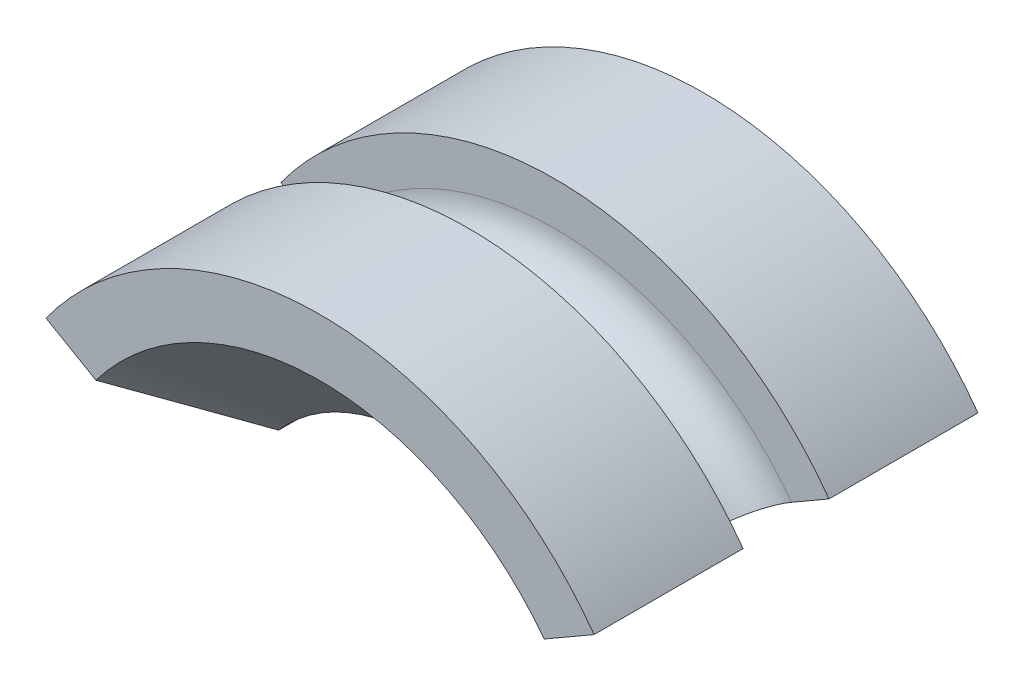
ISO-10303-21;
HEADER;
FILE_DESCRIPTION(('STEP AP214'),'2;1');
FILE_NAME('part.step','',(''),(''),'','','');
FILE_SCHEMA(('AUTOMOTIVE_DESIGN { 1 0 10303 214 1 1 1 1 }'));
ENDSEC;
DATA;
#1=APPLICATION_CONTEXT('core data for automotive mechanical design processes');
#2=APPLICATION_PROTOCOL_DEFINITION('international standard','automotive_design',2000,#1);
#3=PRODUCT_CONTEXT('',#1,'mechanical');
#4=PRODUCT('Part','Part','',(#3));
#5=PRODUCT_RELATED_PRODUCT_CATEGORY('part','',(#4));
#6=PRODUCT_DEFINITION_FORMATION('','',#4);
#7=PRODUCT_DEFINITION_CONTEXT('part definition',#1,'design');
#8=PRODUCT_DEFINITION('design','',#6,#7);
#9=PRODUCT_DEFINITION_SHAPE('','',#8);
#10=(LENGTH_UNIT() NAMED_UNIT(*) SI_UNIT(.MILLI.,.METRE.));
#11=(NAMED_UNIT(*) PLANE_ANGLE_UNIT() SI_UNIT($,.RADIAN.));
#12=(NAMED_UNIT(*) SI_UNIT($,.STERADIAN.) SOLID_ANGLE_UNIT());
#13=UNCERTAINTY_MEASURE_WITH_UNIT(LENGTH_MEASURE(1.E-05),#10,'distance_accuracy_value','');
#14=(GEOMETRIC_REPRESENTATION_CONTEXT(3) GLOBAL_UNCERTAINTY_ASSIGNED_CONTEXT((#13)) GLOBAL_UNIT_ASSIGNED_CONTEXT((#10,
#11,#12)) REPRESENTATION_CONTEXT('',''));
#15=CARTESIAN_POINT('',(0.,0.,0.));
#16=DIRECTION('',(0.,0.,1.));
#17=DIRECTION('',(1.,0.,0.));
#18=AXIS2_PLACEMENT_3D('',#15,#16,#17);
#19=CARTESIAN_POINT('',(0.,0.,0.));
#20=DIRECTION('',(0.,0.,-1.));
#21=DIRECTION('',(0.,1.,0.));
#22=AXIS2_PLACEMENT_3D('',#19,#20,#21);
#23=CYLINDRICAL_SURFACE('',#22,5.9);
#24=CARTESIAN_POINT('',(0.,0.,4.1));
#25=DIRECTION('',(0.,0.,-1.));
#26=DIRECTION('',(0.,1.,0.));
#27=AXIS2_PLACEMENT_3D('',#24,#25,#26);
#28=CIRCLE('',#27,5.9);
#29=CARTESIAN_POINT('',(-4.78306010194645,3.45432136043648,4.09999999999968));
#30=VERTEX_POINT('',#29);
#31=CARTESIAN_POINT('',(4.78306010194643,3.45432136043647,4.10000000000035));
#32=VERTEX_POINT('',#31);
#33=EDGE_CURVE('E109',#30,#32,#28,.T.);
#34=ORIENTED_EDGE('',*,*,#33,.F.);
#35=DIRECTION('',(0.,0.,-1.));
#36=VECTOR('',#35,1.);
#37=CARTESIAN_POINT('',(-4.78306010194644,3.45432136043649,6.69999999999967));
#38=LINE('',#37,#36);
#39=CARTESIAN_POINT('',(-4.78306010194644,3.45432136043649,6.69999999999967));
#40=VERTEX_POINT('',#39);
#41=EDGE_CURVE('E92',#40,#30,#38,.T.);
#42=ORIENTED_EDGE('',*,*,#41,.F.);
#43=CARTESIAN_POINT('',(0.,0.,6.7));
#44=DIRECTION('',(0.,0.,-1.));
#45=DIRECTION('',(0.,1.,0.));
#46=AXIS2_PLACEMENT_3D('',#43,#44,#45);
#47=CIRCLE('',#46,5.9);
#48=CARTESIAN_POINT('',(4.78306010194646,3.45432136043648,6.70000000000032));
#49=VERTEX_POINT('',#48);
#50=EDGE_CURVE('E107',#40,#49,#47,.T.);
#51=ORIENTED_EDGE('',*,*,#50,.T.);
#52=DIRECTION('',(0.,0.,-1.));
#53=VECTOR('',#52,1.);
#54=CARTESIAN_POINT('',(4.78306010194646,3.45432136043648,6.70000000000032));
#55=LINE('',#54,#53);
#56=EDGE_CURVE('E248',#49,#32,#55,.T.);
#57=ORIENTED_EDGE('',*,*,#56,.T.);
#58=EDGE_LOOP('',(#34,#42,#51,#57));
#59=FACE_BOUND('',#58,.T.);
#60=ADVANCED_FACE('F14',(#59),#23,.T.);
#61=CARTESIAN_POINT('',(0.,0.,6.7));
#62=DIRECTION('',(0.,0.,1.));
#63=DIRECTION('',(0.,-1.,0.));
#64=AXIS2_PLACEMENT_3D('',#61,#62,#63);
#65=CONICAL_SURFACE('',#64,4.9,0.785398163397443);
#66=CARTESIAN_POINT('',(0.,0.,6.7));
#67=DIRECTION('',(0.,0.,-1.));
#68=DIRECTION('',(0.,1.,0.));
#69=AXIS2_PLACEMENT_3D('',#66,#67,#68);
#70=CIRCLE('',#69,4.9);
#71=CARTESIAN_POINT('',(-3.91159114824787,2.9511785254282,6.69999999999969));
#72=VERTEX_POINT('',#71);
#73=CARTESIAN_POINT('',(3.91159114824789,2.9511785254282,6.70000000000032));
#74=VERTEX_POINT('',#73);
#75=EDGE_CURVE('E116',#72,#74,#70,.T.);
#76=ORIENTED_EDGE('',*,*,#75,.F.);
#77=CARTESIAN_POINT('',(-3.91176566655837,2.95127928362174,6.70019999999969));
#78=CARTESIAN_POINT('',(-3.78786317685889,2.8797441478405,6.55821006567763));
#79=CARTESIAN_POINT('',(-3.66392328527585,2.80818741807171,6.41626359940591));
#80=CARTESIAN_POINT('',(-3.41593568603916,2.66501171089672,6.1324967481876));
#81=CARTESIAN_POINT('',(-3.29188797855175,2.59339273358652,5.99067636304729));
#82=CARTESIAN_POINT('',(-3.04365124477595,2.45007318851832,5.70720025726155));
#83=CARTESIAN_POINT('',(-2.91946221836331,2.3783726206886,5.56554453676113));
#84=CARTESIAN_POINT('',(-2.67087873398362,2.23485287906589,5.28247322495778));
#85=CARTESIAN_POINT('',(-2.54648427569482,2.16303370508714,5.14105763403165));
#86=CARTESIAN_POINT('',(-2.42195518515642,2.09113680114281,4.99979999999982));
#87=B_SPLINE_CURVE_WITH_KNOTS('',3,(#77,#78,#79,#80,#81,#82,#83,#84,#85,#86),.UNSPECIFIED.,.F.,
.F.,(4,2,2,2,4),(0.,0.604708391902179,1.20941585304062,1.81412384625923,2.41883278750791),.UNSPECIFIED.);
#88=CARTESIAN_POINT('',(-2.42213151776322,2.09123860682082,4.99999999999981));
#89=VERTEX_POINT('',#88);
#90=EDGE_CURVE('E95',#72,#89,#87,.T.);
#91=ORIENTED_EDGE('',*,*,#90,.T.);
#92=CARTESIAN_POINT('',(0.,0.,5.));
#93=DIRECTION('',(0.,0.,-1.));
#94=DIRECTION('',(0.,1.,0.));
#95=AXIS2_PLACEMENT_3D('',#92,#93,#94);
#96=CIRCLE('',#95,3.2);
#97=CARTESIAN_POINT('',(2.42213151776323,2.09123860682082,5.00000000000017));
#98=VERTEX_POINT('',#97);
#99=EDGE_CURVE('E130',#89,#98,#96,.T.);
#100=ORIENTED_EDGE('',*,*,#99,.T.);
#101=CARTESIAN_POINT('',(2.42195518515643,2.0911368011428,4.99980000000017));
#102=CARTESIAN_POINT('',(2.54648427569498,2.16303370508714,5.14105763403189));
#103=CARTESIAN_POINT('',(2.67087873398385,2.2348528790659,5.28247322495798));
#104=CARTESIAN_POINT('',(2.91946221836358,2.37837262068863,5.56554453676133));
#105=CARTESIAN_POINT('',(3.04365124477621,2.45007318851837,5.70720025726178));
#106=CARTESIAN_POINT('',(3.29188797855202,2.5933927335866,5.99067636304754));
#107=CARTESIAN_POINT('',(3.41593568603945,2.66501171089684,6.13249674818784));
#108=CARTESIAN_POINT('',(3.6639232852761,2.80818741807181,6.41626359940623));
#109=CARTESIAN_POINT('',(3.78786317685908,2.87974414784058,6.55821006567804));
#110=CARTESIAN_POINT('',(3.91176566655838,2.95127928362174,6.70020000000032));
#111=B_SPLINE_CURVE_WITH_KNOTS('',3,(#101,#102,#103,#104,#105,#106,#107,#108,#109,#110),
.UNSPECIFIED.,.F.,.F.,(4,2,2,2,4),(0.,0.604708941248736,1.20941693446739,1.81412439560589,
2.41883278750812),.UNSPECIFIED.);
#112=EDGE_CURVE('E181',#98,#74,#111,.T.);
#113=ORIENTED_EDGE('',*,*,#112,.T.);
#114=EDGE_LOOP('',(#76,#91,#100,#113));
#115=FACE_BOUND('',#114,.T.);
#116=ADVANCED_FACE('F16',(#115),#65,.F.);
#117=CARTESIAN_POINT('',(0.,0.,0.));
#118=DIRECTION('',(0.,0.,-1.));
#119=DIRECTION('',(0.,1.,0.));
#120=AXIS2_PLACEMENT_3D('',#117,#118,#119);
#121=CYLINDRICAL_SURFACE('',#120,3.2);
#122=ORIENTED_EDGE('',*,*,#99,.F.);
#123=DIRECTION('',(0.,0.,-1.));
#124=VECTOR('',#123,1.);
#125=CARTESIAN_POINT('',(-2.42213151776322,2.09123860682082,6.69999999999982));
#126=LINE('',#125,#124);
#127=CARTESIAN_POINT('',(-2.42213151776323,2.09123860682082,1.69999999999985));
#128=VERTEX_POINT('',#127);
#129=EDGE_CURVE('E110',#89,#128,#126,.T.);
#130=ORIENTED_EDGE('',*,*,#129,.T.);
#131=CARTESIAN_POINT('',(0.,0.,1.7));
#132=DIRECTION('',(0.,0.,-1.));
#133=DIRECTION('',(0.,1.,0.));
#134=AXIS2_PLACEMENT_3D('',#131,#132,#133);
#135=CIRCLE('',#134,3.2);
#136=CARTESIAN_POINT('',(2.42213151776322,2.09123860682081,1.70000000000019));
#137=VERTEX_POINT('',#136);
#138=EDGE_CURVE('E127',#128,#137,#135,.T.);
#139=ORIENTED_EDGE('',*,*,#138,.T.);
#140=DIRECTION('',(0.,0.,-1.));
#141=VECTOR('',#140,1.);
#142=CARTESIAN_POINT('',(2.42213151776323,2.09123860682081,6.7000000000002));
#143=LINE('',#142,#141);
#144=EDGE_CURVE('E246',#98,#137,#143,.T.);
#145=ORIENTED_EDGE('',*,*,#144,.F.);
#146=EDGE_LOOP('',(#122,#130,#139,#145));
#147=FACE_BOUND('',#146,.T.);
#148=ADVANCED_FACE('F209',(#147),#121,.F.);
#149=CARTESIAN_POINT('',(0.,0.,1.7));
#150=DIRECTION('',(0.,0.,-1.));
#151=DIRECTION('',(0.,1.,0.));
#152=AXIS2_PLACEMENT_3D('',#149,#150,#151);
#153=CONICAL_SURFACE('',#152,3.2,0.785398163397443);
#154=ORIENTED_EDGE('',*,*,#138,.F.);
#155=CARTESIAN_POINT('',(-2.42195518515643,2.09113680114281,1.70019999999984));
#156=CARTESIAN_POINT('',(-2.54648427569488,2.16303370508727,1.5589423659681));
#157=CARTESIAN_POINT('',(-2.6708787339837,2.23485287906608,1.417526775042));
#158=CARTESIAN_POINT('',(-2.9194622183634,2.37837262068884,1.13445546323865));
#159=CARTESIAN_POINT('',(-3.04365124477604,2.45007318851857,0.992799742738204));
#160=CARTESIAN_POINT('',(-3.29188797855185,2.5933927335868,0.709323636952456));
#161=CARTESIAN_POINT('',(-3.41593568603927,2.66501171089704,0.56750325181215));
#162=CARTESIAN_POINT('',(-3.66392328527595,2.80818741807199,0.283736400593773));
#163=CARTESIAN_POINT('',(-3.78786317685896,2.87974414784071,0.141789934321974));
#164=CARTESIAN_POINT('',(-3.91176566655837,2.95127928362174,-0.000200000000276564));
#165=B_SPLINE_CURVE_WITH_KNOTS('',3,(#155,#156,#157,#158,#159,#160,#161,#162,#163,#164),
.UNSPECIFIED.,.F.,.F.,(4,2,2,2,4),(0.,0.604708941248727,1.20941693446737,1.81412439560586,
2.41883278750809),.UNSPECIFIED.);
#166=CARTESIAN_POINT('',(-3.91159114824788,2.9511785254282,-2.77745511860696E-13));
#167=VERTEX_POINT('',#166);
#168=EDGE_CURVE('E160',#128,#167,#165,.T.);
#169=ORIENTED_EDGE('',*,*,#168,.T.);
#170=CARTESIAN_POINT('',(0.,0.,0.));
#171=DIRECTION('',(0.,0.,-1.));
#172=DIRECTION('',(0.,1.,0.));
#173=AXIS2_PLACEMENT_3D('',#170,#171,#172);
#174=CIRCLE('',#173,4.9);
#175=CARTESIAN_POINT('',(3.91159114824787,2.95117852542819,2.75577107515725E-13));
#176=VERTEX_POINT('',#175);
#177=EDGE_CURVE('E119',#167,#176,#174,.T.);
#178=ORIENTED_EDGE('',*,*,#177,.T.);
#179=CARTESIAN_POINT('',(3.91176566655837,2.95127928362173,-0.000199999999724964));
#180=CARTESIAN_POINT('',(3.78786317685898,2.87974414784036,0.141789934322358));
#181=CARTESIAN_POINT('',(3.66392328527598,2.80818741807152,0.283736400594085));
#182=CARTESIAN_POINT('',(3.41593568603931,2.6650117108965,0.567503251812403));
#183=CARTESIAN_POINT('',(3.29188797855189,2.59339273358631,0.70932363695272));
#184=CARTESIAN_POINT('',(3.04365124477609,2.45007318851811,0.992799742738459));
#185=CARTESIAN_POINT('',(2.91946221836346,2.37837262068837,1.13445546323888));
#186=CARTESIAN_POINT('',(2.67087873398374,2.23485287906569,1.41752677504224));
#187=CARTESIAN_POINT('',(2.5464842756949,2.16303370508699,1.55894236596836));
#188=CARTESIAN_POINT('',(2.42195518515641,2.0911368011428,1.70020000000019));
#189=B_SPLINE_CURVE_WITH_KNOTS('',3,(#179,#180,#181,#182,#183,#184,#185,#186,#187,#188),
.UNSPECIFIED.,.F.,.F.,(4,2,2,2,4),(0.,0.604708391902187,1.20941585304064,1.81412384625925,
2.41883278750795),.UNSPECIFIED.);
#190=EDGE_CURVE('E198',#176,#137,#189,.T.);
#191=ORIENTED_EDGE('',*,*,#190,.T.);
#192=EDGE_LOOP('',(#154,#169,#178,#191));
#193=FACE_BOUND('',#192,.T.);
#194=ADVANCED_FACE('F204',(#193),#153,.F.);
#195=CARTESIAN_POINT('',(4.9,0.,3.5319316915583E-13));
#196=DIRECTION('',(0.,0.,-1.));
#197=DIRECTION('',(0.,1.,0.));
#198=AXIS2_PLACEMENT_3D('',#195,#196,#197);
#199=PLANE('',#198);
#200=ORIENTED_EDGE('',*,*,#177,.F.);
#201=DIRECTION('',(-0.866025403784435,0.499999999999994,0.));
#202=VECTOR('',#201,1.);
#203=CARTESIAN_POINT('',(-2.42213151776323,2.09123860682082,-1.71052848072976E-13));
#204=LINE('',#203,#202);
#205=CARTESIAN_POINT('',(-4.78306010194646,3.45432136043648,-3.38196607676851E-13));
#206=VERTEX_POINT('',#205);
#207=EDGE_CURVE('E240',#167,#206,#204,.T.);
#208=ORIENTED_EDGE('',*,*,#207,.T.);
#209=CARTESIAN_POINT('',(0.,0.,0.));
#210=DIRECTION('',(0.,0.,-1.));
#211=DIRECTION('',(0.,1.,0.));
#212=AXIS2_PLACEMENT_3D('',#209,#210,#211);
#213=CIRCLE('',#212,5.9);
#214=CARTESIAN_POINT('',(4.78306010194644,3.45432136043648,3.39931331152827E-13));
#215=VERTEX_POINT('',#214);
#216=EDGE_CURVE('E115',#206,#215,#213,.T.);
#217=ORIENTED_EDGE('',*,*,#216,.T.);
#218=DIRECTION('',(-0.866025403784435,-0.5,0.));
#219=VECTOR('',#218,1.);
#220=CARTESIAN_POINT('',(2.42213151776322,2.09123860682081,1.71052848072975E-13));
#221=LINE('',#220,#219);
#222=EDGE_CURVE('E101',#215,#176,#221,.T.);
#223=ORIENTED_EDGE('',*,*,#222,.T.);
#224=EDGE_LOOP('',(#200,#208,#217,#223));
#225=FACE_BOUND('',#224,.T.);
#226=ADVANCED_FACE('F208',(#225),#199,.T.);
#227=ORIENTED_EDGE('',*,*,#216,.F.);
#228=CARTESIAN_POINT('',(-4.78306010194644,3.45432136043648,2.59999999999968));
#229=VERTEX_POINT('',#228);
#230=EDGE_CURVE('E111',#229,#206,#38,.T.);
#231=ORIENTED_EDGE('',*,*,#230,.F.);
#232=CARTESIAN_POINT('',(0.,0.,2.6));
#233=DIRECTION('',(0.,0.,-1.));
#234=DIRECTION('',(0.,1.,0.));
#235=AXIS2_PLACEMENT_3D('',#232,#233,#234);
#236=CIRCLE('',#235,5.9);
#237=CARTESIAN_POINT('',(4.78306010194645,3.45432136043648,2.60000000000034));
#238=VERTEX_POINT('',#237);
#239=EDGE_CURVE('E149',#229,#238,#236,.T.);
#240=ORIENTED_EDGE('',*,*,#239,.T.);
#241=EDGE_CURVE('E37',#238,#215,#55,.T.);
#242=ORIENTED_EDGE('',*,*,#241,.T.);
#243=EDGE_LOOP('',(#227,#231,#240,#242));
#244=FACE_BOUND('',#243,.T.);
#245=ADVANCED_FACE('F223',(#244),#23,.T.);
#246=CARTESIAN_POINT('',(5.9,0.,6.70000000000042));
#247=DIRECTION('',(0.,0.,1.));
#248=DIRECTION('',(0.,-1.,0.));
#249=AXIS2_PLACEMENT_3D('',#246,#247,#248);
#250=PLANE('',#249);
#251=ORIENTED_EDGE('',*,*,#50,.F.);
#252=DIRECTION('',(-0.866025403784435,0.499999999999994,0.));
#253=VECTOR('',#252,1.);
#254=CARTESIAN_POINT('',(-2.42213151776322,2.09123860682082,6.69999999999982));
#255=LINE('',#254,#253);
#256=EDGE_CURVE('E89',#72,#40,#255,.T.);
#257=ORIENTED_EDGE('',*,*,#256,.F.);
#258=ORIENTED_EDGE('',*,*,#75,.T.);
#259=DIRECTION('',(-0.866025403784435,-0.5,0.));
#260=VECTOR('',#259,1.);
#261=CARTESIAN_POINT('',(2.42213151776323,2.09123860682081,6.7000000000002));
#262=LINE('',#261,#260);
#263=EDGE_CURVE('E100',#49,#74,#262,.T.);
#264=ORIENTED_EDGE('',*,*,#263,.F.);
#265=EDGE_LOOP('',(#251,#257,#258,#264));
#266=FACE_BOUND('',#265,.T.);
#267=ADVANCED_FACE('F114',(#266),#250,.T.);
#268=CARTESIAN_POINT('',(5.9,0.,4.10000000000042));
#269=DIRECTION('',(0.,0.,1.));
#270=DIRECTION('',(0.,-1.,0.));
#271=AXIS2_PLACEMENT_3D('',#268,#269,#270);
#272=PLANE('',#271);
#273=DIRECTION('',(0.866025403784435,-0.499999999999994,0.));
#274=VECTOR('',#273,1.);
#275=CARTESIAN_POINT('',(4.725,-2.03515969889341,4.10000000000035));
#276=LINE('',#275,#274);
#277=CARTESIAN_POINT('',(-4.12965856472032,3.07707980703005,4.09999999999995));
#278=VERTEX_POINT('',#277);
#279=EDGE_CURVE('E180',#30,#278,#276,.T.);
#280=ORIENTED_EDGE('',*,*,#279,.F.);
#281=ORIENTED_EDGE('',*,*,#33,.T.);
#282=DIRECTION('',(0.866025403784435,0.5,0.));
#283=VECTOR('',#282,1.);
#284=CARTESIAN_POINT('',(4.125,3.07439018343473,4.10000000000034));
#285=LINE('',#284,#283);
#286=CARTESIAN_POINT('',(4.1296585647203,3.07707980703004,4.10000000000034));
#287=VERTEX_POINT('',#286);
#288=EDGE_CURVE('E146',#287,#32,#285,.T.);
#289=ORIENTED_EDGE('',*,*,#288,.F.);
#290=CARTESIAN_POINT('',(0.,0.,4.1));
#291=DIRECTION('',(0.,0.,-1.));
#292=DIRECTION('',(0.,1.,0.));
#293=AXIS2_PLACEMENT_3D('',#290,#291,#292);
#294=CIRCLE('',#293,5.15);
#295=EDGE_CURVE('E121',#278,#287,#294,.T.);
#296=ORIENTED_EDGE('',*,*,#295,.F.);
#297=EDGE_LOOP('',(#280,#281,#289,#296));
#298=FACE_BOUND('',#297,.T.);
#299=ADVANCED_FACE('F190',(#298),#272,.F.);
#300=CARTESIAN_POINT('',(0.,0.,3.35));
#301=DIRECTION('',(0.,0.,-1.));
#302=DIRECTION('',(0.,1.,0.));
#303=AXIS2_PLACEMENT_3D('',#300,#301,#302);
#304=TOROIDAL_SURFACE('',#303,5.15,0.75);
#305=CARTESIAN_POINT('',(-4.55390756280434,3.32202008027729,2.77947990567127));
#306=CARTESIAN_POINT('',(-4.5817176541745,3.33807624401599,2.80672855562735));
#307=CARTESIAN_POINT('',(-4.6075623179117,3.35299766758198,2.83669749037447));
#308=CARTESIAN_POINT('',(-4.65455361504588,3.38012810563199,2.90124038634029));
#309=CARTESIAN_POINT('',(-4.67569487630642,3.39233401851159,2.93581954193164));
#310=CARTESIAN_POINT('',(-4.71263733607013,3.41366275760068,3.00858457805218));
#311=CARTESIAN_POINT('',(-4.72844000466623,3.42278643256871,3.04676946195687));
#312=CARTESIAN_POINT('',(-4.7542447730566,3.4376848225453,3.12565790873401));
#313=CARTESIAN_POINT('',(-4.76424828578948,3.44346035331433,3.16636085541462));
#314=CARTESIAN_POINT('',(-4.7781472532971,3.45148492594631,3.24900797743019));
#315=CARTESIAN_POINT('',(-4.78206088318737,3.45374446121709,3.29094807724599));
#316=CARTESIAN_POINT('',(-4.78372264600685,3.45470388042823,3.3749919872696));
#317=CARTESIAN_POINT('',(-4.78147063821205,3.45340368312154,3.4170958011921));
#318=CARTESIAN_POINT('',(-4.77087654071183,3.44728717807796,3.50019011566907));
#319=CARTESIAN_POINT('',(-4.76254555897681,3.44247728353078,3.54118250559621));
#320=CARTESIAN_POINT('',(-4.74004863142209,3.42948867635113,3.62097312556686));
#321=CARTESIAN_POINT('',(-4.72588269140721,3.42130996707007,3.65977135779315));
#322=CARTESIAN_POINT('',(-4.69210600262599,3.40180898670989,3.73412561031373));
#323=CARTESIAN_POINT('',(-4.67248880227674,3.39048299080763,3.76967772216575));
#324=CARTESIAN_POINT('',(-4.62838248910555,3.3650181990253,3.83649306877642));
#325=CARTESIAN_POINT('',(-4.60389330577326,3.35087936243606,3.86775624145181));
#326=CARTESIAN_POINT('',(-4.55063977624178,3.32013342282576,3.9252396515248));
#327=CARTESIAN_POINT('',(-4.52185922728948,3.30351696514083,3.95143987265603));
#328=CARTESIAN_POINT('',(-4.46091470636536,3.26833062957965,3.9979251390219));
#329=CARTESIAN_POINT('',(-4.42875063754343,3.24976069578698,4.01821001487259));
#330=CARTESIAN_POINT('',(-4.36176277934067,3.21108523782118,4.05240864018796));
#331=CARTESIAN_POINT('',(-4.32692529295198,3.19097180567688,4.06628661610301));
#332=CARTESIAN_POINT('',(-4.25573290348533,3.14986886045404,4.08713249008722));
#333=CARTESIAN_POINT('',(-4.21937795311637,3.12887932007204,4.09410017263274));
#334=CARTESIAN_POINT('',(-4.14597339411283,3.0864991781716,4.10096174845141));
#335=CARTESIAN_POINT('',(-4.10892109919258,3.06510702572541,4.1008173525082));
#336=CARTESIAN_POINT('',(-4.03535955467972,3.02263624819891,4.09337074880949));
#337=CARTESIAN_POINT('',(-3.99885031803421,3.00155763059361,4.08606837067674));
#338=CARTESIAN_POINT('',(-3.92729892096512,2.96024741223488,4.06447812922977));
#339=CARTESIAN_POINT('',(-3.89226142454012,2.94001850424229,4.0501696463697));
#340=CARTESIAN_POINT('',(-3.8247678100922,2.9010510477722,4.0149539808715));
#341=CARTESIAN_POINT('',(-3.79231169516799,2.88231250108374,3.99404679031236));
#342=CARTESIAN_POINT('',(-3.73096203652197,2.84689225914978,3.94624879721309));
#343=CARTESIAN_POINT('',(-3.70206319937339,2.83020750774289,3.9193670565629));
#344=CARTESIAN_POINT('',(-3.64861483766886,2.79934908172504,3.86035041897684));
#345=CARTESIAN_POINT('',(-3.6240651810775,2.78517533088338,3.82821568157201));
#346=CARTESIAN_POINT('',(-3.58018471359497,2.75984093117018,3.75981797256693));
#347=CARTESIAN_POINT('',(-3.56082181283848,2.74866175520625,3.72358245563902));
#348=CARTESIAN_POINT('',(-3.52769208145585,2.72953429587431,3.64784722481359));
#349=CARTESIAN_POINT('',(-3.51392496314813,2.72158584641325,3.60834767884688));
#350=CARTESIAN_POINT('',(-3.49249877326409,2.709215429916,3.52756804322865));
#351=CARTESIAN_POINT('',(-3.48478850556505,2.70476390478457,3.48630605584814));
#352=CARTESIAN_POINT('',(-3.47551616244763,2.69941051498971,3.40287152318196));
#353=CARTESIAN_POINT('',(-3.47395383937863,2.69850850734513,3.36069901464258));
#354=CARTESIAN_POINT('',(-3.47701561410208,2.70027622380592,3.27690331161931));
#355=CARTESIAN_POINT('',(-3.48160352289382,2.70292505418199,3.23527834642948));
#356=CARTESIAN_POINT('',(-3.49676322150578,2.71167751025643,3.15350849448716));
#357=CARTESIAN_POINT('',(-3.50733497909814,2.71778111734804,3.11336359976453));
#358=CARTESIAN_POINT('',(-3.53415415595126,2.73326517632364,3.03565954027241));
#359=CARTESIAN_POINT('',(-3.55040505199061,2.74264763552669,2.99810197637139));
#360=CARTESIAN_POINT('',(-3.58810230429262,2.76441215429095,2.92664196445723));
#361=CARTESIAN_POINT('',(-3.60954883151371,2.77679431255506,2.89273963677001));
#362=CARTESIAN_POINT('',(-3.65717549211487,2.80429157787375,2.82930778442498));
#363=CARTESIAN_POINT('',(-3.68338603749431,2.81942424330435,2.79980871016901));
#364=CARTESIAN_POINT('',(-3.73969263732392,2.85193287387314,2.74625820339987));
#365=CARTESIAN_POINT('',(-3.76978887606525,2.86930894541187,2.72220702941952));
#366=CARTESIAN_POINT('',(-3.83328704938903,2.9059696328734,2.68002379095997));
#367=CARTESIAN_POINT('',(-3.86671480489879,2.92526915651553,2.66194354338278));
#368=CARTESIAN_POINT('',(-3.93571336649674,2.96510549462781,2.63247817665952));
#369=CARTESIAN_POINT('',(-3.97128416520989,2.98564230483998,2.6210930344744));
#370=CARTESIAN_POINT('',(-4.04377500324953,3.02749490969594,2.60528533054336));
#371=CARTESIAN_POINT('',(-4.08070148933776,3.04881442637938,2.60090216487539));
#372=CARTESIAN_POINT('',(-4.15467849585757,3.09152507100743,2.59934905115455));
#373=CARTESIAN_POINT('',(-4.19172904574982,3.11291621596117,2.60218095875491));
#374=CARTESIAN_POINT('',(-4.26493729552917,3.15518301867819,2.61499715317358));
#375=CARTESIAN_POINT('',(-4.30109376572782,3.1760579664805,2.62499077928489));
#376=CARTESIAN_POINT('',(-4.37139997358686,3.21664927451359,2.6518669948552));
#377=CARTESIAN_POINT('',(-4.40555208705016,3.23636700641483,2.66874123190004));
#378=CARTESIAN_POINT('',(-4.45882366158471,3.26712336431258,2.70147576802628));
#379=CARTESIAN_POINT('',(-4.47884499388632,3.27868268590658,2.7154182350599));
#380=CARTESIAN_POINT('',(-4.51748208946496,3.30098982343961,2.74569522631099));
#381=CARTESIAN_POINT('',(-4.53609785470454,3.31173764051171,2.76202974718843));
#382=CARTESIAN_POINT('',(-4.55390756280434,3.32202008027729,2.77947990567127));
#383=B_SPLINE_CURVE_WITH_KNOTS('',3,(#305,#306,#307,#308,#309,#310,#311,#312,#313,#314,#315,
#316,#317,#318,#319,#320,#321,#322,#323,#324,#325,#326,#327,#328,#329,#330,#331,#332,#333,#334,
#335,#336,#337,#338,#339,#340,#341,#342,#343,#344,#345,#346,#347,#348,#349,#350,#351,#352,#353,
#354,#355,#356,#357,#358,#359,#360,#361,#362,#363,#364,#365,#366,#367,#368,#369,#370,#371,#372,
#373,#374,#375,#376,#377,#378,#379,#380,#381,#382),.UNSPECIFIED.,.T.,.F.,(4,2,2,2,2,2,2,2,2,2,2,
2,2,2,2,2,2,2,2,2,2,2,2,2,2,2,2,2,2,2,2,2,2,2,2,2,2,2,4),(0.,0.126247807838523,
0.252639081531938,0.378995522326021,0.505321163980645,0.631269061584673,0.757219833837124,
0.882941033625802,1.00866210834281,1.13453261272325,1.26040493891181,1.38676515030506,
1.5131289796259,1.64019008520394,1.76725515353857,1.89500437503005,2.02275663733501,
2.15088716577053,2.27901784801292,2.40695549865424,2.53488926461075,2.6620122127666,
2.78912862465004,2.91515865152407,3.04118360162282,3.16647024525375,3.29175621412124,
3.41711901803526,3.5424859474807,3.66868324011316,3.79488652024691,3.92215787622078,
4.04942879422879,4.17741330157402,4.30543072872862,4.43361540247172,4.56164493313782,
4.64249471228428,4.72334437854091),.UNSPECIFIED.);
#384=CARTESIAN_POINT('',(-4.12965856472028,3.07707980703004,2.59999999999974));
#385=VERTEX_POINT('',#384);
#386=EDGE_CURVE('E29',#278,#385,#383,.T.);
#387=ORIENTED_EDGE('',*,*,#386,.F.);
#388=ORIENTED_EDGE('',*,*,#295,.T.);
#389=CARTESIAN_POINT('',(3.5525248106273,2.74387147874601,2.99601497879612));
#390=CARTESIAN_POINT('',(3.53530647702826,2.73393046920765,3.03282308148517));
#391=CARTESIAN_POINT('',(3.52075572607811,2.72552958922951,3.07132805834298));
#392=CARTESIAN_POINT('',(3.49744342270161,2.71207022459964,3.15064169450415));
#393=CARTESIAN_POINT('',(3.48868829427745,2.70701544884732,3.19145285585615));
#394=CARTESIAN_POINT('',(3.47724962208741,2.70041132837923,3.2741868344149));
#395=CARTESIAN_POINT('',(3.47456436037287,2.69886099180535,3.31610933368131));
#396=CARTESIAN_POINT('',(3.47534445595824,2.69931138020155,3.39986719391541));
#397=CARTESIAN_POINT('',(3.47880836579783,2.70131126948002,3.44170257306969));
#398=CARTESIAN_POINT('',(3.49176383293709,2.70879111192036,3.52401479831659));
#399=CARTESIAN_POINT('',(3.50124225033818,2.71426347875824,3.56449440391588));
#400=CARTESIAN_POINT('',(3.52593097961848,2.72851752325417,3.6430522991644));
#401=CARTESIAN_POINT('',(3.54114156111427,2.73729935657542,3.68113047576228));
#402=CARTESIAN_POINT('',(3.57690618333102,2.75794807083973,3.75394828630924));
#403=CARTESIAN_POINT('',(3.59747806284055,2.76982525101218,3.78867623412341));
#404=CARTESIAN_POINT('',(3.64334168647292,2.79630462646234,3.85369193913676));
#405=CARTESIAN_POINT('',(3.66863361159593,2.81090692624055,3.8839795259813));
#406=CARTESIAN_POINT('',(3.72343409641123,2.84254600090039,3.93951387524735));
#407=CARTESIAN_POINT('',(3.75297469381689,2.85960127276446,3.96471848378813));
#408=CARTESIAN_POINT('',(3.81527797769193,2.8955720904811,4.009095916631));
#409=CARTESIAN_POINT('',(3.8480408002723,2.9144877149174,4.0282684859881));
#410=CARTESIAN_POINT('',(3.91613396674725,2.95380132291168,4.06018675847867));
#411=CARTESIAN_POINT('',(3.95148230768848,2.97420969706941,4.07288128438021));
#412=CARTESIAN_POINT('',(4.02351989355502,3.01580061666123,4.09126720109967));
#413=CARTESIAN_POINT('',(4.06020917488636,3.03698318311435,4.09695840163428));
#414=CARTESIAN_POINT('',(4.13403651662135,3.0796074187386,4.10118427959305));
#415=CARTESIAN_POINT('',(4.1711757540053,3.10104976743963,4.09969162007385));
#416=CARTESIAN_POINT('',(4.24470919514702,3.14350431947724,4.08952004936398));
#417=CARTESIAN_POINT('',(4.28110339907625,3.16451652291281,4.08084113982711));
#418=CARTESIAN_POINT('',(4.35206767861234,3.20548776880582,4.05654283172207));
#419=CARTESIAN_POINT('',(4.38663971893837,3.22544794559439,4.04093108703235));
#420=CARTESIAN_POINT('',(4.45300808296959,3.2637657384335,4.00319693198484));
#421=CARTESIAN_POINT('',(4.48480446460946,3.28212338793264,3.98107465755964));
#422=CARTESIAN_POINT('',(4.54456057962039,3.31662359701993,3.93105247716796));
#423=CARTESIAN_POINT('',(4.57253724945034,3.33277593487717,3.90317955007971));
#424=CARTESIAN_POINT('',(4.6240117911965,3.36249477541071,3.84237757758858));
#425=CARTESIAN_POINT('',(4.64750979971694,3.37606135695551,3.80944868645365));
#426=CARTESIAN_POINT('',(4.68921739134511,3.40014124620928,3.7396728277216));
#427=CARTESIAN_POINT('',(4.70745656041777,3.41067163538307,3.70284943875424));
#428=CARTESIAN_POINT('',(4.7382923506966,3.42847468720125,3.62617686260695));
#429=CARTESIAN_POINT('',(4.75088913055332,3.43574744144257,3.58632776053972));
#430=CARTESIAN_POINT('',(4.77002378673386,3.44679484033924,3.50494013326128));
#431=CARTESIAN_POINT('',(4.77659034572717,3.45058604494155,3.46341059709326));
#432=CARTESIAN_POINT('',(4.78357585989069,3.45461913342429,3.37966800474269));
#433=CARTESIAN_POINT('',(4.78399492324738,3.45486107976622,3.33745496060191));
#434=CARTESIAN_POINT('',(4.77867987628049,3.45179243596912,3.25365206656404));
#435=CARTESIAN_POINT('',(4.77296068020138,3.44849045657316,3.21206095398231));
#436=CARTESIAN_POINT('',(4.75555935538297,3.43844379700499,3.13057706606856));
#437=CARTESIAN_POINT('',(4.74387723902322,3.43169912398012,3.09068428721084));
#438=CARTESIAN_POINT('',(4.71488146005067,3.41495840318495,3.01370293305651));
#439=CARTESIAN_POINT('',(4.69756476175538,3.40496060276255,2.97661588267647));
#440=CARTESIAN_POINT('',(4.65780206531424,3.38200359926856,2.9063104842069));
#441=CARTESIAN_POINT('',(4.63535600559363,3.36904436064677,2.87309218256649));
#442=CARTESIAN_POINT('',(4.58589497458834,3.34048802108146,2.81134391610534));
#443=CARTESIAN_POINT('',(4.55886492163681,3.32488221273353,2.78283006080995));
#444=CARTESIAN_POINT('',(4.50106152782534,3.2915094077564,2.73141411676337));
#445=CARTESIAN_POINT('',(4.4702880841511,3.27374235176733,2.70851218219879));
#446=CARTESIAN_POINT('',(4.40569839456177,3.23645147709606,2.66883949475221));
#447=CARTESIAN_POINT('',(4.37186692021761,3.21691886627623,2.65210180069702));
#448=CARTESIAN_POINT('',(4.30225930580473,3.1767308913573,2.62538126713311));
#449=CARTESIAN_POINT('',(4.26648310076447,3.15607548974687,2.615398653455));
#450=CARTESIAN_POINT('',(4.19378676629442,3.11410424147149,2.60241639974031));
#451=CARTESIAN_POINT('',(4.15686134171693,3.09278533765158,2.59945628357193));
#452=CARTESIAN_POINT('',(4.08310286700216,3.05020086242,2.60070792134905));
#453=CARTESIAN_POINT('',(4.04626981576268,3.02893529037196,2.60491958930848));
#454=CARTESIAN_POINT('',(3.97360134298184,2.98698012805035,2.62042104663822));
#455=CARTESIAN_POINT('',(3.93776996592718,2.96629287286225,2.63173612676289));
#456=CARTESIAN_POINT('',(3.86825157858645,2.92615641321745,2.66115793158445));
#457=CARTESIAN_POINT('',(3.83456511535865,2.906707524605,2.67926638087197));
#458=CARTESIAN_POINT('',(3.77031220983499,2.86961109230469,2.72177061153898));
#459=CARTESIAN_POINT('',(3.7397459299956,2.85196364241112,2.74616672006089));
#460=CARTESIAN_POINT('',(3.68264770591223,2.81899796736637,2.80055214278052));
#461=CARTESIAN_POINT('',(3.65611086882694,2.80367691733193,2.83053457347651));
#462=CARTESIAN_POINT('',(3.61671038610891,2.7809290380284,2.88333120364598));
#463=CARTESIAN_POINT('',(3.60240431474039,2.77266942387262,2.90473422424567));
#464=CARTESIAN_POINT('',(3.5758697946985,2.7573497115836,2.94919405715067));
#465=CARTESIAN_POINT('',(3.56364134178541,2.75028961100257,2.97225086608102));
#466=CARTESIAN_POINT('',(3.5525248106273,2.74387147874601,2.99601497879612));
#467=B_SPLINE_CURVE_WITH_KNOTS('',3,(#389,#390,#391,#392,#393,#394,#395,#396,#397,#398,#399,
#400,#401,#402,#403,#404,#405,#406,#407,#408,#409,#410,#411,#412,#413,#414,#415,#416,#417,#418,
#419,#420,#421,#422,#423,#424,#425,#426,#427,#428,#429,#430,#431,#432,#433,#434,#435,#436,#437,
#438,#439,#440,#441,#442,#443,#444,#445,#446,#447,#448,#449,#450,#451,#452,#453,#454,#455,#456,
#457,#458,#459,#460,#461,#462,#463,#464,#465,#466),.UNSPECIFIED.,.T.,.F.,(4,2,2,2,2,2,2,2,2,2,2,
2,2,2,2,2,2,2,2,2,2,2,2,2,2,2,2,2,2,2,2,2,2,2,2,2,2,2,4),(0.,0.12540583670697,0.25095044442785,
0.376459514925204,0.501939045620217,0.62714538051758,0.752357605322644,0.87799189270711,
1.00363099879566,1.13027269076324,1.25691973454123,1.38455238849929,1.51218851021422,
1.64031071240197,1.76843288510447,1.89641396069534,2.02439236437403,2.15178348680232,
2.27917072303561,2.40582663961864,2.53247899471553,2.65852576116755,2.78457030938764,
2.91030929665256,3.03604802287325,3.16185460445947,3.28766269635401,3.41389303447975,
3.54012684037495,3.66702810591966,3.79393361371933,3.92155169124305,4.04916823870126,
4.17724174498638,4.30534778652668,4.43346049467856,4.56141637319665,4.64238127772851,
4.72334601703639),.UNSPECIFIED.);
#468=CARTESIAN_POINT('',(4.12965856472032,3.07707980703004,2.60000000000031));
#469=VERTEX_POINT('',#468);
#470=EDGE_CURVE('E134',#469,#287,#467,.T.);
#471=ORIENTED_EDGE('',*,*,#470,.F.);
#472=CARTESIAN_POINT('',(0.,0.,2.6));
#473=DIRECTION('',(0.,0.,-1.));
#474=DIRECTION('',(0.,1.,0.));
#475=AXIS2_PLACEMENT_3D('',#472,#473,#474);
#476=CIRCLE('',#475,5.15);
#477=EDGE_CURVE('E144',#385,#469,#476,.T.);
#478=ORIENTED_EDGE('',*,*,#477,.F.);
#479=EDGE_LOOP('',(#387,#388,#471,#478));
#480=FACE_BOUND('',#479,.T.);
#481=ADVANCED_FACE('F143',(#480),#304,.F.);
#482=CARTESIAN_POINT('',(5.89999999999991,0.,2.6000000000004));
#483=DIRECTION('',(0.,0.,-1.));
#484=DIRECTION('',(0.,1.,0.));
#485=AXIS2_PLACEMENT_3D('',#482,#483,#484);
#486=PLANE('',#485);
#487=DIRECTION('',(-0.866025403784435,0.499999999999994,0.));
#488=VECTOR('',#487,1.);
#489=CARTESIAN_POINT('',(4.725,-2.03515969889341,2.60000000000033));
#490=LINE('',#489,#488);
#491=EDGE_CURVE('E9',#385,#229,#490,.T.);
#492=ORIENTED_EDGE('',*,*,#491,.F.);
#493=ORIENTED_EDGE('',*,*,#477,.T.);
#494=DIRECTION('',(-0.866025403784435,-0.5,0.));
#495=VECTOR('',#494,1.);
#496=CARTESIAN_POINT('',(4.125,3.07439018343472,2.60000000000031));
#497=LINE('',#496,#495);
#498=EDGE_CURVE('E23',#238,#469,#497,.T.);
#499=ORIENTED_EDGE('',*,*,#498,.F.);
#500=ORIENTED_EDGE('',*,*,#239,.F.);
#501=EDGE_LOOP('',(#492,#493,#499,#500));
#502=FACE_BOUND('',#501,.T.);
#503=ADVANCED_FACE('F148',(#502),#486,.F.);
#504=CARTESIAN_POINT('',(2.42213151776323,2.09123860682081,6.7000000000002));
#505=DIRECTION('',(0.5,-0.866025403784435,0.));
#506=DIRECTION('',(0.866025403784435,0.5,0.));
#507=AXIS2_PLACEMENT_3D('',#504,#505,#506);
#508=PLANE('',#507);
#509=ORIENTED_EDGE('',*,*,#144,.T.);
#510=ORIENTED_EDGE('',*,*,#190,.F.);
#511=ORIENTED_EDGE('',*,*,#222,.F.);
#512=ORIENTED_EDGE('',*,*,#241,.F.);
#513=ORIENTED_EDGE('',*,*,#498,.T.);
#514=ORIENTED_EDGE('',*,*,#470,.T.);
#515=ORIENTED_EDGE('',*,*,#288,.T.);
#516=ORIENTED_EDGE('',*,*,#56,.F.);
#517=ORIENTED_EDGE('',*,*,#263,.T.);
#518=ORIENTED_EDGE('',*,*,#112,.F.);
#519=EDGE_LOOP('',(#509,#510,#511,#512,#513,#514,#515,#516,#517,#518));
#520=FACE_BOUND('',#519,.T.);
#521=ADVANCED_FACE('F133',(#520),#508,.T.);
#522=CARTESIAN_POINT('',(-2.42213151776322,2.09123860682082,6.69999999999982));
#523=DIRECTION('',(-0.499999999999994,-0.866025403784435,0.));
#524=DIRECTION('',(0.866025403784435,-0.499999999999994,0.));
#525=AXIS2_PLACEMENT_3D('',#522,#523,#524);
#526=PLANE('',#525);
#527=ORIENTED_EDGE('',*,*,#256,.T.);
#528=ORIENTED_EDGE('',*,*,#41,.T.);
#529=ORIENTED_EDGE('',*,*,#279,.T.);
#530=ORIENTED_EDGE('',*,*,#386,.T.);
#531=ORIENTED_EDGE('',*,*,#491,.T.);
#532=ORIENTED_EDGE('',*,*,#230,.T.);
#533=ORIENTED_EDGE('',*,*,#207,.F.);
#534=ORIENTED_EDGE('',*,*,#168,.F.);
#535=ORIENTED_EDGE('',*,*,#129,.F.);
#536=ORIENTED_EDGE('',*,*,#90,.F.);
#537=EDGE_LOOP('',(#527,#528,#529,#530,#531,#532,#533,#534,#535,#536));
#538=FACE_BOUND('',#537,.T.);
#539=ADVANCED_FACE('F91',(#538),#526,.T.);
#540=CLOSED_SHELL('',(#60,#116,#148,#194,#226,#245,#267,#299,#481,#503,#521,#539));
#541=MANIFOLD_SOLID_BREP('B1',#540);
#542=ADVANCED_BREP_SHAPE_REPRESENTATION('',(#18,#541),#14);
#543=SHAPE_DEFINITION_REPRESENTATION(#9,#542);
ENDSEC;
END-ISO-10303-21;
